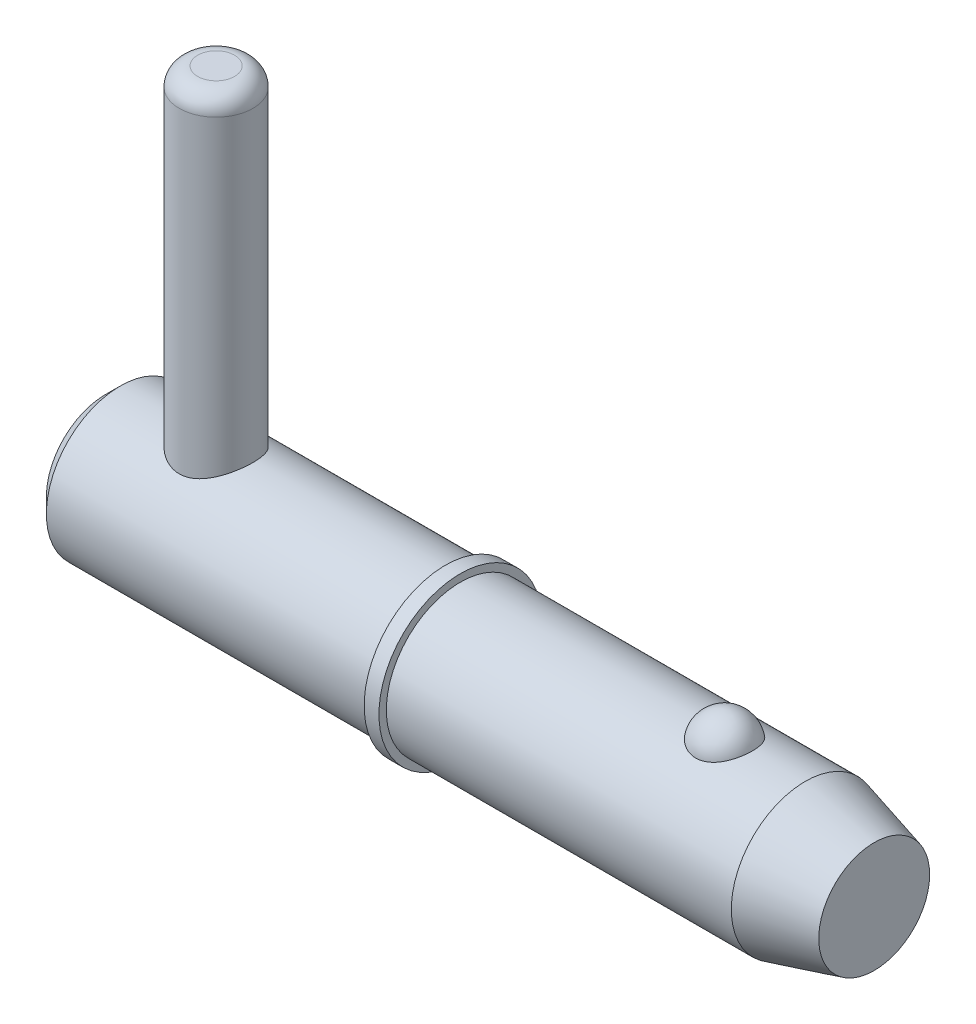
ISO-10303-21;
HEADER;
FILE_DESCRIPTION(('STEP AP214'),'2;1');
FILE_NAME('part.step','',(''),(''),'','','');
FILE_SCHEMA(('AUTOMOTIVE_DESIGN { 1 0 10303 214 1 1 1 1 }'));
ENDSEC;
DATA;
#1=APPLICATION_CONTEXT('core data for automotive mechanical design processes');
#2=APPLICATION_PROTOCOL_DEFINITION('international standard','automotive_design',2000,#1);
#3=PRODUCT_CONTEXT('',#1,'mechanical');
#4=PRODUCT('Part','Part','',(#3));
#5=PRODUCT_RELATED_PRODUCT_CATEGORY('part','',(#4));
#6=PRODUCT_DEFINITION_FORMATION('','',#4);
#7=PRODUCT_DEFINITION_CONTEXT('part definition',#1,'design');
#8=PRODUCT_DEFINITION('design','',#6,#7);
#9=PRODUCT_DEFINITION_SHAPE('','',#8);
#10=(LENGTH_UNIT() NAMED_UNIT(*) SI_UNIT(.MILLI.,.METRE.));
#11=(NAMED_UNIT(*) PLANE_ANGLE_UNIT() SI_UNIT($,.RADIAN.));
#12=(NAMED_UNIT(*) SI_UNIT($,.STERADIAN.) SOLID_ANGLE_UNIT());
#13=UNCERTAINTY_MEASURE_WITH_UNIT(LENGTH_MEASURE(1.E-05),#10,'distance_accuracy_value','');
#14=(GEOMETRIC_REPRESENTATION_CONTEXT(3) GLOBAL_UNCERTAINTY_ASSIGNED_CONTEXT((#13)) GLOBAL_UNIT_ASSIGNED_CONTEXT((#10,
#11,#12)) REPRESENTATION_CONTEXT('',''));
#15=CARTESIAN_POINT('',(0.,0.,0.));
#16=DIRECTION('',(0.,0.,1.));
#17=DIRECTION('',(1.,0.,0.));
#18=AXIS2_PLACEMENT_3D('',#15,#16,#17);
#19=CARTESIAN_POINT('',(5.94,21.43,0.));
#20=DIRECTION('',(0.,-1.,0.));
#21=DIRECTION('',(0.,0.,-1.));
#22=AXIS2_PLACEMENT_3D('',#19,#20,#21);
#23=CYLINDRICAL_SURFACE('',#22,1.98);
#24=CARTESIAN_POINT('',(5.94,-2.98,0.));
#25=DIRECTION('',(0.,1.,0.));
#26=DIRECTION('',(0.,0.,1.));
#27=AXIS2_PLACEMENT_3D('',#24,#25,#26);
#28=CIRCLE('',#27,1.98);
#29=CARTESIAN_POINT('',(5.94,-2.98,1.98));
#30=VERTEX_POINT('',#29);
#31=EDGE_CURVE('P0_E25',#30,#30,#28,.T.);
#32=ORIENTED_EDGE('',*,*,#31,.T.);
#33=EDGE_LOOP('',(#32));
#34=FACE_BOUND('',#33,.T.);
#35=CARTESIAN_POINT('',(5.94,20.44,0.));
#36=DIRECTION('',(0.,1.,0.));
#37=DIRECTION('',(0.,0.,1.));
#38=AXIS2_PLACEMENT_3D('',#35,#36,#37);
#39=CIRCLE('',#38,1.98);
#40=CARTESIAN_POINT('',(5.94,20.44,1.98));
#41=VERTEX_POINT('',#40);
#42=EDGE_CURVE('P0_E29',#41,#41,#39,.F.);
#43=ORIENTED_EDGE('',*,*,#42,.T.);
#44=EDGE_LOOP('',(#43));
#45=FACE_BOUND('',#44,.T.);
#46=ADVANCED_FACE('P0_F14',(#34,#45),#23,.T.);
#47=CARTESIAN_POINT('',(5.94,21.43,0.));
#48=DIRECTION('',(0.,1.,0.));
#49=DIRECTION('',(0.,0.,1.));
#50=AXIS2_PLACEMENT_3D('',#47,#48,#49);
#51=PLANE('',#50);
#52=CARTESIAN_POINT('',(5.94,21.43,0.));
#53=DIRECTION('',(0.,1.,0.));
#54=DIRECTION('',(0.,0.,1.));
#55=AXIS2_PLACEMENT_3D('',#52,#53,#54);
#56=CIRCLE('',#55,0.99);
#57=CARTESIAN_POINT('',(5.94,21.43,0.99));
#58=VERTEX_POINT('',#57);
#59=EDGE_CURVE('P0_E10',#58,#58,#56,.T.);
#60=ORIENTED_EDGE('',*,*,#59,.T.);
#61=EDGE_LOOP('',(#60));
#62=FACE_BOUND('',#61,.T.);
#63=ADVANCED_FACE('P0_F46',(#62),#51,.T.);
#64=CARTESIAN_POINT('',(5.94,-3.97,0.));
#65=DIRECTION('',(0.,1.,0.));
#66=DIRECTION('',(0.,0.,1.));
#67=AXIS2_PLACEMENT_3D('',#64,#65,#66);
#68=PLANE('',#67);
#69=CARTESIAN_POINT('',(5.94,-3.97,0.));
#70=DIRECTION('',(0.,1.,0.));
#71=DIRECTION('',(0.,0.,1.));
#72=AXIS2_PLACEMENT_3D('',#69,#70,#71);
#73=CIRCLE('',#72,0.99);
#74=CARTESIAN_POINT('',(5.94,-3.97,0.99));
#75=VERTEX_POINT('',#74);
#76=EDGE_CURVE('P0_E21',#75,#75,#73,.F.);
#77=ORIENTED_EDGE('',*,*,#76,.T.);
#78=EDGE_LOOP('',(#77));
#79=FACE_BOUND('',#78,.T.);
#80=ADVANCED_FACE('P0_F43',(#79),#68,.F.);
#81=CARTESIAN_POINT('',(5.94,-2.98,0.));
#82=DIRECTION('',(0.,1.,0.));
#83=DIRECTION('',(0.,0.,1.));
#84=AXIS2_PLACEMENT_3D('',#81,#82,#83);
#85=DEGENERATE_TOROIDAL_SURFACE('',#84,0.99,0.99,.T.);
#86=ORIENTED_EDGE('',*,*,#76,.F.);
#87=EDGE_LOOP('',(#86));
#88=FACE_BOUND('',#87,.T.);
#89=ORIENTED_EDGE('',*,*,#31,.F.);
#90=EDGE_LOOP('',(#89));
#91=FACE_BOUND('',#90,.T.);
#92=ADVANCED_FACE('P0_F38',(#88,#91),#85,.T.);
#93=CARTESIAN_POINT('',(5.94,20.44,0.));
#94=DIRECTION('',(0.,1.,0.));
#95=DIRECTION('',(0.,0.,1.));
#96=AXIS2_PLACEMENT_3D('',#93,#94,#95);
#97=DEGENERATE_TOROIDAL_SURFACE('',#96,0.99,0.99,.T.);
#98=ORIENTED_EDGE('',*,*,#42,.F.);
#99=EDGE_LOOP('',(#98));
#100=FACE_BOUND('',#99,.T.);
#101=ORIENTED_EDGE('',*,*,#59,.F.);
#102=EDGE_LOOP('',(#101));
#103=FACE_BOUND('',#102,.T.);
#104=ADVANCED_FACE('P0_F16',(#100,#103),#97,.T.);
#105=CLOSED_SHELL('',(#46,#63,#80,#92,#104));
#106=MANIFOLD_SOLID_BREP('P0_B1',#105);
#107=CARTESIAN_POINT('',(0.,0.,0.));
#108=DIRECTION('',(1.,0.,0.));
#109=DIRECTION('',(0.,0.,-1.));
#110=AXIS2_PLACEMENT_3D('',#107,#108,#109);
#111=CYLINDRICAL_SURFACE('',#110,3.97);
#112=CARTESIAN_POINT('',(37.5759395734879,0.,0.));
#113=DIRECTION('',(1.,0.,0.));
#114=DIRECTION('',(0.,0.,-1.));
#115=AXIS2_PLACEMENT_3D('',#112,#113,#114);
#116=CIRCLE('',#115,3.97);
#117=CARTESIAN_POINT('',(37.5759395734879,0.,-3.97));
#118=VERTEX_POINT('',#117);
#119=EDGE_CURVE('P1_E81',#118,#118,#116,.T.);
#120=ORIENTED_EDGE('',*,*,#119,.F.);
#121=EDGE_LOOP('',(#120));
#122=FACE_BOUND('',#121,.T.);
#123=CARTESIAN_POINT('',(19.05,0.,0.));
#124=DIRECTION('',(1.,0.,0.));
#125=DIRECTION('',(0.,0.,-1.));
#126=AXIS2_PLACEMENT_3D('',#123,#124,#125);
#127=CIRCLE('',#126,3.97);
#128=CARTESIAN_POINT('',(19.05,0.,-3.97));
#129=VERTEX_POINT('',#128);
#130=EDGE_CURVE('P1_E85',#129,#129,#127,.T.);
#131=ORIENTED_EDGE('',*,*,#130,.T.);
#132=EDGE_LOOP('',(#131));
#133=FACE_BOUND('',#132,.T.);
#134=CARTESIAN_POINT('',(33.2451922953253,3.65715365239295,1.54470941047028));
#135=CARTESIAN_POINT('',(33.1652448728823,3.65716001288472,1.54470290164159));
#136=CARTESIAN_POINT('',(33.0851650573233,3.65987074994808,1.53832549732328));
#137=CARTESIAN_POINT('',(32.9272374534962,3.6704221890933,1.51297018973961));
#138=CARTESIAN_POINT('',(32.8493961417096,3.67827646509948,1.49395894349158));
#139=CARTESIAN_POINT('',(32.6984614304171,3.69818848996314,1.44395950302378));
#140=CARTESIAN_POINT('',(32.6253560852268,3.71023513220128,1.41300293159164));
#141=CARTESIAN_POINT('',(32.4855630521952,3.7372183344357,1.34000212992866));
#142=CARTESIAN_POINT('',(32.4188725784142,3.75215363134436,1.29796274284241));
#143=CARTESIAN_POINT('',(32.2914886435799,3.78384968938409,1.20248834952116));
#144=CARTESIAN_POINT('',(32.2310299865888,3.80065129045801,1.14875388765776));
#145=CARTESIAN_POINT('',(32.1196942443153,3.83398532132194,1.03205417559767));
#146=CARTESIAN_POINT('',(32.0688200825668,3.85051766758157,0.969086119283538));
#147=CARTESIAN_POINT('',(31.9756321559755,3.88238608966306,0.832526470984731));
#148=CARTESIAN_POINT('',(31.9337961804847,3.89763698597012,0.75858832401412));
#149=CARTESIAN_POINT('',(31.8625108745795,3.92451063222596,0.604352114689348));
#150=CARTESIAN_POINT('',(31.8330623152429,3.93613315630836,0.524053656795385));
#151=CARTESIAN_POINT('',(31.7868927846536,3.95467606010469,0.358403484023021));
#152=CARTESIAN_POINT('',(31.7703127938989,3.96154426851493,0.273006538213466));
#153=CARTESIAN_POINT('',(31.750756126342,3.96967008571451,0.100408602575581));
#154=CARTESIAN_POINT('',(31.7477789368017,3.97092790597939,0.0132076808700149));
#155=CARTESIAN_POINT('',(31.7554587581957,3.96771794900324,-0.159844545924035));
#156=CARTESIAN_POINT('',(31.7660164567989,3.96329187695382,-0.245701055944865));
#157=CARTESIAN_POINT('',(31.8003800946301,3.94923163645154,-0.414277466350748));
#158=CARTESIAN_POINT('',(31.8241862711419,3.93959737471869,-0.496997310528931));
#159=CARTESIAN_POINT('',(31.8846114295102,3.91607752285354,-0.657113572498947));
#160=CARTESIAN_POINT('',(31.9212495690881,3.90218558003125,-0.734501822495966));
#161=CARTESIAN_POINT('',(32.0065935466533,3.87158287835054,-0.881704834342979));
#162=CARTESIAN_POINT('',(32.0553004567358,3.8548718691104,-0.951518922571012));
#163=CARTESIAN_POINT('',(32.1641161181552,3.82028735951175,-1.08208159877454));
#164=CARTESIAN_POINT('',(32.2242955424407,3.80240713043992,-1.14276958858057));
#165=CARTESIAN_POINT('',(32.354493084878,3.76758161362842,-1.2528243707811));
#166=CARTESIAN_POINT('',(32.4245105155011,3.75063626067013,-1.30219195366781));
#167=CARTESIAN_POINT('',(32.57118160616,3.71998948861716,-1.38729709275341));
#168=CARTESIAN_POINT('',(32.6476813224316,3.70623183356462,-1.42327904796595));
#169=CARTESIAN_POINT('',(32.8062981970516,3.68323188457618,-1.48178996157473));
#170=CARTESIAN_POINT('',(32.8884132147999,3.67398788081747,-1.5043240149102));
#171=CARTESIAN_POINT('',(33.0514810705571,3.6615216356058,-1.53440939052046));
#172=CARTESIAN_POINT('',(33.1322840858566,3.65801951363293,-1.54265826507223));
#173=CARTESIAN_POINT('',(33.2942085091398,3.65657341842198,-1.5460842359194));
#174=CARTESIAN_POINT('',(33.3753298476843,3.65862829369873,-1.54126404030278));
#175=CARTESIAN_POINT('',(33.5328122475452,3.66788969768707,-1.51908474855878));
#176=CARTESIAN_POINT('',(33.6092422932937,3.67492621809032,-1.50213925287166));
#177=CARTESIAN_POINT('',(33.7580412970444,3.69318404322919,-1.45666982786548));
#178=CARTESIAN_POINT('',(33.8304099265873,3.70440568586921,-1.42814496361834));
#179=CARTESIAN_POINT('',(33.9708029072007,3.73012749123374,-1.35956319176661));
#180=CARTESIAN_POINT('',(34.0387000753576,3.74469307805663,-1.31927107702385));
#181=CARTESIAN_POINT('',(34.1668649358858,3.77545272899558,-1.22847440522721));
#182=CARTESIAN_POINT('',(34.2271308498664,3.79164717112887,-1.17796747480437));
#183=CARTESIAN_POINT('',(34.3416346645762,3.82490325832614,-1.06519260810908));
#184=CARTESIAN_POINT('',(34.3954137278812,3.84196735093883,-1.00245914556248));
#185=CARTESIAN_POINT('',(34.4920988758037,3.87439863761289,-0.868715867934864));
#186=CARTESIAN_POINT('',(34.5350030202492,3.88976552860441,-0.797704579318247));
#187=CARTESIAN_POINT('',(34.610266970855,3.91771381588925,-0.646896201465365));
#188=CARTESIAN_POINT('',(34.6422532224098,3.93019255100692,-0.566893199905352));
#189=CARTESIAN_POINT('',(34.6931101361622,3.95043886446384,-0.40225513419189));
#190=CARTESIAN_POINT('',(34.7119807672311,3.95820643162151,-0.317620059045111));
#191=CARTESIAN_POINT('',(34.7362162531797,3.96823733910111,-0.14615699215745));
#192=CARTESIAN_POINT('',(34.7415874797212,3.970503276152,-0.0593300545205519));
#193=CARTESIAN_POINT('',(34.7387309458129,3.96930811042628,0.114057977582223));
#194=CARTESIAN_POINT('',(34.7305035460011,3.9658471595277,0.200619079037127));
#195=CARTESIAN_POINT('',(34.7007063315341,3.95358562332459,0.370506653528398));
#196=CARTESIAN_POINT('',(34.6792129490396,3.94481563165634,0.453848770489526));
#197=CARTESIAN_POINT('',(34.6233839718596,3.92284586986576,0.615497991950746));
#198=CARTESIAN_POINT('',(34.5890474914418,3.90964579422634,0.693804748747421));
#199=CARTESIAN_POINT('',(34.5079702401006,3.88006987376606,0.843703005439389));
#200=CARTESIAN_POINT('',(34.4611536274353,3.86367478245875,0.915249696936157));
#201=CARTESIAN_POINT('',(34.3561897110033,3.82949741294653,1.04910810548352));
#202=CARTESIAN_POINT('',(34.2980428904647,3.81171519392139,1.11142021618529));
#203=CARTESIAN_POINT('',(34.1717433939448,3.77673366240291,1.22503948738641));
#204=CARTESIAN_POINT('',(34.1035970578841,3.75953398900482,1.27635357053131));
#205=CARTESIAN_POINT('',(33.9589009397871,3.72770506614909,1.36653336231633));
#206=CARTESIAN_POINT('',(33.882348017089,3.71307678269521,1.40539439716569));
#207=CARTESIAN_POINT('',(33.7257594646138,3.68864287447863,1.46830480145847));
#208=CARTESIAN_POINT('',(33.6459307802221,3.67869017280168,1.49281289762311));
#209=CARTESIAN_POINT('',(33.4829877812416,3.66414535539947,1.52817474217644));
#210=CARTESIAN_POINT('',(33.3998840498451,3.65953723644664,1.53906926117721));
#211=CARTESIAN_POINT('',(33.2927760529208,3.6573894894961,1.54414878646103));
#212=CARTESIAN_POINT('',(33.2689900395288,3.65715175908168,1.54471134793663));
#213=CARTESIAN_POINT('',(33.2451922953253,3.65715365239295,1.54470941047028));
#214=B_SPLINE_CURVE_WITH_KNOTS('',3,(#134,#135,#136,#137,#138,#139,#140,#141,#142,#143,#144,
#145,#146,#147,#148,#149,#150,#151,#152,#153,#154,#155,#156,#157,#158,#159,#160,#161,#162,#163,
#164,#165,#166,#167,#168,#169,#170,#171,#172,#173,#174,#175,#176,#177,#178,#179,#180,#181,#182,
#183,#184,#185,#186,#187,#188,#189,#190,#191,#192,#193,#194,#195,#196,#197,#198,#199,#200,#201,
#202,#203,#204,#205,#206,#207,#208,#209,#210,#211,#212,#213),.UNSPECIFIED.,.T.,.F.,(4,2,2,2,2,2,
2,2,2,2,2,2,2,2,2,2,2,2,2,2,2,2,2,2,2,2,2,2,2,2,2,2,2,2,2,2,2,2,2,4),(0.,0.239777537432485,
0.480190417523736,0.719971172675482,0.959647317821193,1.20639040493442,1.45320863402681,
1.7109367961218,1.96868099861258,2.22921052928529,2.48973023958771,2.74834928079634,
3.00697295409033,3.26598440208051,3.52501886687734,3.78570385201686,4.04637062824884,
4.30201257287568,4.55755760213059,4.80022994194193,5.04285200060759,5.27757006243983,
5.51230707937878,5.75210128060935,5.99195126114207,6.24392810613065,6.49594987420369,
6.75588818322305,7.01582710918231,7.27564332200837,7.53545264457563,7.79377886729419,
8.0521229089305,8.31207418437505,8.57201437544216,8.83179046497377,9.09166393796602,
9.34270057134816,9.59298357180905,9.66435753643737),.UNSPECIFIED.);
#215=CARTESIAN_POINT('',(33.2451922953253,3.65715365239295,1.54470941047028));
#216=VERTEX_POINT('',#215);
#217=EDGE_CURVE('P1_E35',#216,#216,#214,.T.);
#218=ORIENTED_EDGE('',*,*,#217,.T.);
#219=EDGE_LOOP('',(#218));
#220=FACE_BOUND('',#219,.T.);
#221=ADVANCED_FACE('P1_F13',(#122,#133,#220),#111,.T.);
#222=CARTESIAN_POINT('',(0.,0.,0.));
#223=DIRECTION('',(-1.,0.,0.));
#224=DIRECTION('',(0.,0.,1.));
#225=AXIS2_PLACEMENT_3D('',#222,#223,#224);
#226=PLANE('',#225);
#227=CARTESIAN_POINT('',(0.,0.,0.));
#228=DIRECTION('',(1.,0.,0.));
#229=DIRECTION('',(0.,0.,-1.));
#230=AXIS2_PLACEMENT_3D('',#227,#228,#229);
#231=CIRCLE('',#230,3.176);
#232=CARTESIAN_POINT('',(0.,0.,-3.176));
#233=VERTEX_POINT('',#232);
#234=EDGE_CURVE('P1_E9',#233,#233,#231,.T.);
#235=ORIENTED_EDGE('',*,*,#234,.F.);
#236=EDGE_LOOP('',(#235));
#237=FACE_BOUND('',#236,.T.);
#238=ADVANCED_FACE('P1_F15',(#237),#226,.T.);
#239=CARTESIAN_POINT('',(0.793999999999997,0.,0.));
#240=DIRECTION('',(1.,0.,0.));
#241=DIRECTION('',(0.,0.,-1.));
#242=AXIS2_PLACEMENT_3D('',#239,#240,#241);
#243=CONICAL_SURFACE('',#242,3.97,0.78539816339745);
#244=ORIENTED_EDGE('',*,*,#234,.T.);
#245=EDGE_LOOP('',(#244));
#246=FACE_BOUND('',#245,.T.);
#247=CARTESIAN_POINT('',(0.793999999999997,0.,0.));
#248=DIRECTION('',(1.,0.,0.));
#249=DIRECTION('',(0.,0.,-1.));
#250=AXIS2_PLACEMENT_3D('',#247,#248,#249);
#251=CIRCLE('',#250,3.97);
#252=CARTESIAN_POINT('',(0.793999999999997,0.,-3.97));
#253=VERTEX_POINT('',#252);
#254=EDGE_CURVE('P1_E26',#253,#253,#251,.T.);
#255=ORIENTED_EDGE('',*,*,#254,.F.);
#256=EDGE_LOOP('',(#255));
#257=FACE_BOUND('',#256,.T.);
#258=ADVANCED_FACE('P1_F77',(#246,#257),#243,.T.);
#259=CARTESIAN_POINT('',(0.,0.,0.));
#260=DIRECTION('',(1.,0.,0.));
#261=DIRECTION('',(0.,0.,-1.));
#262=AXIS2_PLACEMENT_3D('',#259,#260,#261);
#263=CYLINDRICAL_SURFACE('',#262,3.97);
#264=CARTESIAN_POINT('',(5.94,-3.44100276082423,1.98));
#265=CARTESIAN_POINT('',(5.8367885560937,-3.44101282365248,1.97999171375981));
#266=CARTESIAN_POINT('',(5.73344176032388,-3.44571749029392,1.97187534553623));
#267=CARTESIAN_POINT('',(5.52991905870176,-3.46385873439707,1.93981946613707));
#268=CARTESIAN_POINT('',(5.42975031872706,-3.47731375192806,1.91584653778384));
#269=CARTESIAN_POINT('',(5.23590869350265,-3.51100678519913,1.85336773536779));
#270=CARTESIAN_POINT('',(5.14220446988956,-3.53120882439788,1.81493880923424));
#271=CARTESIAN_POINT('',(4.9625969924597,-3.57606420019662,1.72487335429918));
#272=CARTESIAN_POINT('',(4.87669412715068,-3.6007177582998,1.67323616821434));
#273=CARTESIAN_POINT('',(4.70734412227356,-3.65417020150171,1.55325205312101));
#274=CARTESIAN_POINT('',(4.62467662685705,-3.68314323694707,1.4838818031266));
#275=CARTESIAN_POINT('',(4.47154355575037,-3.74056406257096,1.33252902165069));
#276=CARTESIAN_POINT('',(4.40108404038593,-3.76901158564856,1.25054026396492));
#277=CARTESIAN_POINT('',(4.26974803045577,-3.82445556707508,1.06956584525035));
#278=CARTESIAN_POINT('',(4.20982960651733,-3.8512271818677,0.969809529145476));
#279=CARTESIAN_POINT('',(4.10798077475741,-3.89804342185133,0.760047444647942));
#280=CARTESIAN_POINT('',(4.06603907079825,-3.91809226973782,0.650048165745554));
#281=CARTESIAN_POINT('',(4.00441878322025,-3.94794912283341,0.431181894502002));
#282=CARTESIAN_POINT('',(3.98337329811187,-3.95838209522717,0.322786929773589));
#283=CARTESIAN_POINT('',(3.9596425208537,-3.97016407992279,0.103541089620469));
#284=CARTESIAN_POINT('',(3.95694618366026,-3.97151855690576,-0.00730826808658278));
#285=CARTESIAN_POINT('',(3.9694599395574,-3.96528826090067,-0.218044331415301));
#286=CARTESIAN_POINT('',(3.98314071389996,-3.95846689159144,-0.318049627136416));
#287=CARTESIAN_POINT('',(4.02528522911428,-3.93780347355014,-0.514124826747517));
#288=CARTESIAN_POINT('',(4.05375007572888,-3.92396089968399,-0.61019443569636));
#289=CARTESIAN_POINT('',(4.12484256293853,-3.89028355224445,-0.797351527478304));
#290=CARTESIAN_POINT('',(4.16766142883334,-3.87036821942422,-0.888351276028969));
#291=CARTESIAN_POINT('',(4.26598377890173,-3.82634285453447,-1.06209448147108));
#292=CARTESIAN_POINT('',(4.32149181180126,-3.8022313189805,-1.14483496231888));
#293=CARTESIAN_POINT('',(4.44962332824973,-3.74940011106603,-1.30802500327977));
#294=CARTESIAN_POINT('',(4.52336636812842,-3.72046031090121,-1.38752498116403));
#295=CARTESIAN_POINT('',(4.68287656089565,-3.66269463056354,-1.53354043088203));
#296=CARTESIAN_POINT('',(4.7686527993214,-3.63386885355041,-1.60004599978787));
#297=CARTESIAN_POINT('',(4.9564069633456,-3.57763161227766,-1.72228426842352));
#298=CARTESIAN_POINT('',(5.05906485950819,-3.5504233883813,-1.77707534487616));
#299=CARTESIAN_POINT('',(5.27381412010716,-3.50334038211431,-1.86819784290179));
#300=CARTESIAN_POINT('',(5.38589553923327,-3.48345798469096,-1.90454844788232));
#301=CARTESIAN_POINT('',(5.6069795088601,-3.45548331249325,-1.95481643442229));
#302=CARTESIAN_POINT('',(5.71552407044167,-3.44658268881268,-1.97028113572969));
#303=CARTESIAN_POINT('',(5.93399639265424,-3.43928114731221,-1.98300600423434));
#304=CARTESIAN_POINT('',(6.04392313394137,-3.44087289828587,-1.98027888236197));
#305=CARTESIAN_POINT('',(6.24931618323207,-3.45351901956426,-1.95811780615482));
#306=CARTESIAN_POINT('',(6.34505668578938,-3.46352725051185,-1.94052989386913));
#307=CARTESIAN_POINT('',(6.53204702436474,-3.49033612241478,-1.89188242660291));
#308=CARTESIAN_POINT('',(6.62329540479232,-3.50713894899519,-1.86081853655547));
#309=CARTESIAN_POINT('',(6.80352105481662,-3.54655680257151,-1.78458666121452));
#310=CARTESIAN_POINT('',(6.89219712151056,-3.56940508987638,-1.73883178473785));
#311=CARTESIAN_POINT('',(7.06112449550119,-3.61813012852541,-1.63502913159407));
#312=CARTESIAN_POINT('',(7.14137144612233,-3.6440084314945,-1.57697504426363));
#313=CARTESIAN_POINT('',(7.30168083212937,-3.69977514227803,-1.44171920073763));
#314=CARTESIAN_POINT('',(7.38046039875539,-3.7297597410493,-1.36302972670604));
#315=CARTESIAN_POINT('',(7.52409649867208,-3.78754991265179,-1.19307190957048));
#316=CARTESIAN_POINT('',(7.58894840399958,-3.81535475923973,-1.10179940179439));
#317=CARTESIAN_POINT('',(7.70430122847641,-3.86658972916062,-0.906019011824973));
#318=CARTESIAN_POINT('',(7.75438714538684,-3.88988795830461,-0.801229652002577));
#319=CARTESIAN_POINT('',(7.83572184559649,-3.92848199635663,-0.583216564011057));
#320=CARTESIAN_POINT('',(7.86698708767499,-3.94378479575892,-0.470000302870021));
#321=CARTESIAN_POINT('',(7.90711051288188,-3.96355307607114,-0.249525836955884));
#322=CARTESIAN_POINT('',(7.91775648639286,-3.96888171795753,-0.142669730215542));
#323=CARTESIAN_POINT('',(7.92160247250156,-3.97079858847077,0.0714191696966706));
#324=CARTESIAN_POINT('',(7.91480852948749,-3.96738984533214,0.178651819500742));
#325=CARTESIAN_POINT('',(7.88515479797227,-3.9527181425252,0.383072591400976));
#326=CARTESIAN_POINT('',(7.8633739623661,-3.94198303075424,0.480459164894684));
#327=CARTESIAN_POINT('',(7.80581513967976,-3.91422178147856,0.670038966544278));
#328=CARTESIAN_POINT('',(7.77003513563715,-3.89719473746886,0.762231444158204));
#329=CARTESIAN_POINT('',(7.68389191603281,-3.85747818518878,0.943248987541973));
#330=CARTESIAN_POINT('',(7.63296879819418,-3.83457704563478,1.03175978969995));
#331=CARTESIAN_POINT('',(7.51869140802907,-3.7855122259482,1.19934744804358));
#332=CARTESIAN_POINT('',(7.45533142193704,-3.75934704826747,1.2784199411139));
#333=CARTESIAN_POINT('',(7.31068939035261,-3.70329841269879,1.433144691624));
#334=CARTESIAN_POINT('',(7.22825362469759,-3.67330340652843,1.50768183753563));
#335=CARTESIAN_POINT('',(7.05162367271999,-3.61514025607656,1.64226879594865));
#336=CARTESIAN_POINT('',(6.95741928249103,-3.58697372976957,1.70230590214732));
#337=CARTESIAN_POINT('',(6.75590859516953,-3.53504049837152,1.80775364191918));
#338=CARTESIAN_POINT('',(6.64828786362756,-3.51143624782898,1.85265616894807));
#339=CARTESIAN_POINT('',(6.48137774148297,-3.48289659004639,1.90544537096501));
#340=CARTESIAN_POINT('',(6.42488151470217,-3.4745323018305,1.9206071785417));
#341=CARTESIAN_POINT('',(6.31046920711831,-3.4604244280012,1.94591259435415));
#342=CARTESIAN_POINT('',(6.25255415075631,-3.45467900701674,1.95605971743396));
#343=CARTESIAN_POINT('',(6.1521444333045,-3.44728060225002,1.96905939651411));
#344=CARTESIAN_POINT('',(6.10985721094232,-3.44493297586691,1.97315742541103));
#345=CARTESIAN_POINT('',(6.02505433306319,-3.44179192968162,1.97862952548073));
#346=CARTESIAN_POINT('',(5.98253866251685,-3.44099861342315,1.98000341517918));
#347=CARTESIAN_POINT('',(5.94,-3.44100276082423,1.98));
#348=B_SPLINE_CURVE_WITH_KNOTS('',3,(#264,#265,#266,#267,#268,#269,#270,#271,#272,#273,#274,
#275,#276,#277,#278,#279,#280,#281,#282,#283,#284,#285,#286,#287,#288,#289,#290,#291,#292,#293,
#294,#295,#296,#297,#298,#299,#300,#301,#302,#303,#304,#305,#306,#307,#308,#309,#310,#311,#312,
#313,#314,#315,#316,#317,#318,#319,#320,#321,#322,#323,#324,#325,#326,#327,#328,#329,#330,#331,
#332,#333,#334,#335,#336,#337,#338,#339,#340,#341,#342,#343,#344,#345,#346,#347),.UNSPECIFIED.,
.T.,.F.,(4,2,2,2,2,2,2,2,2,2,2,2,2,2,2,2,2,2,2,2,2,2,2,2,2,2,2,2,2,2,2,2,2,2,2,2,2,2,2,2,2,4),
(0.,0.309462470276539,0.619579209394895,0.928068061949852,1.23657226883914,1.57038619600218,
1.90436536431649,2.26071614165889,2.61684266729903,2.94773555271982,3.27842924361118,
3.58050679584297,3.88260694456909,4.18890317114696,4.49530936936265,4.83057163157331,
5.1660884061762,5.52272472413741,5.87898927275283,6.20706708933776,6.53491569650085,
6.82716910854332,7.11951660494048,7.42541184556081,7.73146442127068,8.07586334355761,
8.42037652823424,8.77380887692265,9.12693169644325,9.44775848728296,9.76847409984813,
10.0682302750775,10.3680296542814,10.6806938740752,10.9935020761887,11.3373031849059,
11.6814044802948,12.0361164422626,12.2131519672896,12.3900632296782,12.5175998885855,
12.6451450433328),.UNSPECIFIED.);
#349=CARTESIAN_POINT('',(5.94,-3.44100276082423,1.98));
#350=VERTEX_POINT('',#349);
#351=EDGE_CURVE('P1_E17',#350,#350,#348,.T.);
#352=ORIENTED_EDGE('',*,*,#351,.F.);
#353=EDGE_LOOP('',(#352));
#354=FACE_BOUND('',#353,.T.);
#355=CARTESIAN_POINT('',(5.94,3.44100276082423,1.98));
#356=CARTESIAN_POINT('',(6.0432114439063,3.44101282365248,1.97999171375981));
#357=CARTESIAN_POINT('',(6.14655823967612,3.44571749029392,1.97187534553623));
#358=CARTESIAN_POINT('',(6.35008094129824,3.46385873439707,1.93981946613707));
#359=CARTESIAN_POINT('',(6.45024968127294,3.47731375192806,1.91584653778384));
#360=CARTESIAN_POINT('',(6.64409130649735,3.51100678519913,1.85336773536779));
#361=CARTESIAN_POINT('',(6.73779553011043,3.53120882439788,1.81493880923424));
#362=CARTESIAN_POINT('',(6.91740300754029,3.57606420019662,1.72487335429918));
#363=CARTESIAN_POINT('',(7.00330587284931,3.6007177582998,1.67323616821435));
#364=CARTESIAN_POINT('',(7.17265587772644,3.65417020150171,1.55325205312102));
#365=CARTESIAN_POINT('',(7.25532337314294,3.68314323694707,1.4838818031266));
#366=CARTESIAN_POINT('',(7.40845644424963,3.74056406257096,1.3325290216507));
#367=CARTESIAN_POINT('',(7.47891595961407,3.76901158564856,1.25054026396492));
#368=CARTESIAN_POINT('',(7.61025196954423,3.82445556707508,1.06956584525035));
#369=CARTESIAN_POINT('',(7.67017039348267,3.8512271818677,0.969809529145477));
#370=CARTESIAN_POINT('',(7.77201922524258,3.89804342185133,0.760047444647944));
#371=CARTESIAN_POINT('',(7.81396092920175,3.91809226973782,0.650048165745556));
#372=CARTESIAN_POINT('',(7.87558121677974,3.94794912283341,0.431181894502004));
#373=CARTESIAN_POINT('',(7.89662670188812,3.95838209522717,0.322786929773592));
#374=CARTESIAN_POINT('',(7.9203574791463,3.97016407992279,0.103541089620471));
#375=CARTESIAN_POINT('',(7.92305381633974,3.97151855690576,-0.00730826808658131));
#376=CARTESIAN_POINT('',(7.9105400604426,3.96528826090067,-0.2180443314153));
#377=CARTESIAN_POINT('',(7.89685928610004,3.95846689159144,-0.318049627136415));
#378=CARTESIAN_POINT('',(7.85471477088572,3.93780347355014,-0.514124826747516));
#379=CARTESIAN_POINT('',(7.82624992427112,3.92396089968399,-0.61019443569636));
#380=CARTESIAN_POINT('',(7.75515743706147,3.89028355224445,-0.797351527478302));
#381=CARTESIAN_POINT('',(7.71233857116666,3.87036821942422,-0.888351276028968));
#382=CARTESIAN_POINT('',(7.61401622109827,3.82634285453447,-1.06209448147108));
#383=CARTESIAN_POINT('',(7.55850818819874,3.8022313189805,-1.14483496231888));
#384=CARTESIAN_POINT('',(7.43037667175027,3.74940011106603,-1.30802500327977));
#385=CARTESIAN_POINT('',(7.35663363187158,3.72046031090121,-1.38752498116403));
#386=CARTESIAN_POINT('',(7.19712343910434,3.66269463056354,-1.53354043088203));
#387=CARTESIAN_POINT('',(7.1113472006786,3.63386885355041,-1.60004599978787));
#388=CARTESIAN_POINT('',(6.9235930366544,3.57763161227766,-1.72228426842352));
#389=CARTESIAN_POINT('',(6.82093514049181,3.5504233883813,-1.77707534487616));
#390=CARTESIAN_POINT('',(6.60618587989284,3.50334038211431,-1.86819784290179));
#391=CARTESIAN_POINT('',(6.49410446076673,3.48345798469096,-1.90454844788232));
#392=CARTESIAN_POINT('',(6.2730204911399,3.45548331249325,-1.95481643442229));
#393=CARTESIAN_POINT('',(6.16447592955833,3.44658268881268,-1.97028113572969));
#394=CARTESIAN_POINT('',(5.94600360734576,3.43928114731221,-1.98300600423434));
#395=CARTESIAN_POINT('',(5.83607686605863,3.44087289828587,-1.98027888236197));
#396=CARTESIAN_POINT('',(5.63068381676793,3.45351901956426,-1.95811780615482));
#397=CARTESIAN_POINT('',(5.53494331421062,3.46352725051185,-1.94052989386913));
#398=CARTESIAN_POINT('',(5.34795297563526,3.49033612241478,-1.89188242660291));
#399=CARTESIAN_POINT('',(5.25670459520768,3.50713894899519,-1.86081853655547));
#400=CARTESIAN_POINT('',(5.07647894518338,3.54655680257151,-1.78458666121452));
#401=CARTESIAN_POINT('',(4.98780287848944,3.56940508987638,-1.73883178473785));
#402=CARTESIAN_POINT('',(4.81887550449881,3.61813012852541,-1.63502913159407));
#403=CARTESIAN_POINT('',(4.73862855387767,3.6440084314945,-1.57697504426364));
#404=CARTESIAN_POINT('',(4.57831916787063,3.69977514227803,-1.44171920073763));
#405=CARTESIAN_POINT('',(4.49953960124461,3.7297597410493,-1.36302972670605));
#406=CARTESIAN_POINT('',(4.35590350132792,3.78754991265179,-1.19307190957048));
#407=CARTESIAN_POINT('',(4.29105159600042,3.81535475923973,-1.10179940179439));
#408=CARTESIAN_POINT('',(4.17569877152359,3.86658972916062,-0.906019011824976));
#409=CARTESIAN_POINT('',(4.12561285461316,3.88988795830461,-0.80122965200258));
#410=CARTESIAN_POINT('',(4.04427815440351,3.92848199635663,-0.58321656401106));
#411=CARTESIAN_POINT('',(4.01301291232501,3.94378479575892,-0.470000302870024));
#412=CARTESIAN_POINT('',(3.97288948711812,3.96355307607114,-0.249525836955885));
#413=CARTESIAN_POINT('',(3.96224351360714,3.96888171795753,-0.142669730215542));
#414=CARTESIAN_POINT('',(3.95839752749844,3.97079858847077,0.0714191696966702));
#415=CARTESIAN_POINT('',(3.96519147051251,3.96738984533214,0.178651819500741));
#416=CARTESIAN_POINT('',(3.99484520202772,3.9527181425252,0.383072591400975));
#417=CARTESIAN_POINT('',(4.01662603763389,3.94198303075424,0.480459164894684));
#418=CARTESIAN_POINT('',(4.07418486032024,3.91422178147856,0.670038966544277));
#419=CARTESIAN_POINT('',(4.10996486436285,3.89719473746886,0.762231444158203));
#420=CARTESIAN_POINT('',(4.19610808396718,3.85747818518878,0.943248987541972));
#421=CARTESIAN_POINT('',(4.24703120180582,3.83457704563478,1.03175978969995));
#422=CARTESIAN_POINT('',(4.36130859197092,3.7855122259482,1.19934744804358));
#423=CARTESIAN_POINT('',(4.42466857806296,3.75934704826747,1.2784199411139));
#424=CARTESIAN_POINT('',(4.56931060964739,3.70329841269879,1.433144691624));
#425=CARTESIAN_POINT('',(4.65174637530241,3.67330340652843,1.50768183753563));
#426=CARTESIAN_POINT('',(4.82837632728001,3.61514025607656,1.64226879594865));
#427=CARTESIAN_POINT('',(4.92258071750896,3.58697372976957,1.70230590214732));
#428=CARTESIAN_POINT('',(5.12409140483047,3.53504049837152,1.80775364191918));
#429=CARTESIAN_POINT('',(5.23171213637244,3.51143624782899,1.85265616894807));
#430=CARTESIAN_POINT('',(5.39862225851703,3.48289659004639,1.90544537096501));
#431=CARTESIAN_POINT('',(5.45511848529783,3.4745323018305,1.9206071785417));
#432=CARTESIAN_POINT('',(5.56953079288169,3.4604244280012,1.94591259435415));
#433=CARTESIAN_POINT('',(5.62744584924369,3.45467900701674,1.95605971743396));
#434=CARTESIAN_POINT('',(5.7278555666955,3.44728060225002,1.9690593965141));
#435=CARTESIAN_POINT('',(5.77014278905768,3.44493297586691,1.97315742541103));
#436=CARTESIAN_POINT('',(5.85494566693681,3.44179192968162,1.97862952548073));
#437=CARTESIAN_POINT('',(5.89746133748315,3.44099861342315,1.98000341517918));
#438=CARTESIAN_POINT('',(5.94,3.44100276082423,1.98));
#439=B_SPLINE_CURVE_WITH_KNOTS('',3,(#355,#356,#357,#358,#359,#360,#361,#362,#363,#364,#365,
#366,#367,#368,#369,#370,#371,#372,#373,#374,#375,#376,#377,#378,#379,#380,#381,#382,#383,#384,
#385,#386,#387,#388,#389,#390,#391,#392,#393,#394,#395,#396,#397,#398,#399,#400,#401,#402,#403,
#404,#405,#406,#407,#408,#409,#410,#411,#412,#413,#414,#415,#416,#417,#418,#419,#420,#421,#422,
#423,#424,#425,#426,#427,#428,#429,#430,#431,#432,#433,#434,#435,#436,#437,#438),.UNSPECIFIED.,
.T.,.F.,(4,2,2,2,2,2,2,2,2,2,2,2,2,2,2,2,2,2,2,2,2,2,2,2,2,2,2,2,2,2,2,2,2,2,2,2,2,2,2,2,2,4),
(0.,0.309462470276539,0.619579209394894,0.928068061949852,1.23657226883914,1.57038619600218,
1.90436536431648,2.26071614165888,2.61684266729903,2.94773555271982,3.27842924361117,
3.58050679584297,3.88260694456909,4.18890317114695,4.49530936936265,4.83057163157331,
5.1660884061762,5.5227247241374,5.87898927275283,6.20706708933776,6.53491569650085,
6.82716910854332,7.11951660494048,7.42541184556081,7.73146442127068,8.07586334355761,
8.42037652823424,8.77380887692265,9.12693169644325,9.44775848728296,9.76847409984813,
10.0682302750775,10.3680296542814,10.6806938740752,10.9935020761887,11.3373031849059,
11.6814044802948,12.0361164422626,12.2131519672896,12.3900632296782,12.5175998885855,
12.6451450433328),.UNSPECIFIED.);
#440=CARTESIAN_POINT('',(5.94,3.44100276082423,1.98));
#441=VERTEX_POINT('',#440);
#442=EDGE_CURVE('P1_E43',#441,#441,#439,.T.);
#443=ORIENTED_EDGE('',*,*,#442,.F.);
#444=EDGE_LOOP('',(#443));
#445=FACE_BOUND('',#444,.T.);
#446=ORIENTED_EDGE('',*,*,#254,.T.);
#447=EDGE_LOOP('',(#446));
#448=FACE_BOUND('',#447,.T.);
#449=CARTESIAN_POINT('',(18.256,0.,0.));
#450=DIRECTION('',(1.,0.,0.));
#451=DIRECTION('',(0.,0.,-1.));
#452=AXIS2_PLACEMENT_3D('',#449,#450,#451);
#453=CIRCLE('',#452,3.97);
#454=CARTESIAN_POINT('',(18.256,0.,-3.97));
#455=VERTEX_POINT('',#454);
#456=EDGE_CURVE('P1_E31',#455,#455,#453,.T.);
#457=ORIENTED_EDGE('',*,*,#456,.F.);
#458=EDGE_LOOP('',(#457));
#459=FACE_BOUND('',#458,.T.);
#460=ADVANCED_FACE('P1_F103',(#354,#445,#448,#459),#263,.T.);
#461=CARTESIAN_POINT('',(18.256,3.97,0.));
#462=DIRECTION('',(-1.,0.,0.));
#463=DIRECTION('',(0.,0.,1.));
#464=AXIS2_PLACEMENT_3D('',#461,#462,#463);
#465=PLANE('',#464);
#466=ORIENTED_EDGE('',*,*,#456,.T.);
#467=EDGE_LOOP('',(#466));
#468=FACE_BOUND('',#467,.T.);
#469=CARTESIAN_POINT('',(18.256,0.,0.));
#470=DIRECTION('',(1.,0.,0.));
#471=DIRECTION('',(0.,0.,-1.));
#472=AXIS2_PLACEMENT_3D('',#469,#470,#471);
#473=CIRCLE('',#472,4.367);
#474=CARTESIAN_POINT('',(18.256,0.,-4.367));
#475=VERTEX_POINT('',#474);
#476=EDGE_CURVE('P1_E91',#475,#475,#473,.T.);
#477=ORIENTED_EDGE('',*,*,#476,.F.);
#478=EDGE_LOOP('',(#477));
#479=FACE_BOUND('',#478,.T.);
#480=ADVANCED_FACE('P1_F100',(#468,#479),#465,.T.);
#481=CARTESIAN_POINT('',(0.,0.,0.));
#482=DIRECTION('',(1.,0.,0.));
#483=DIRECTION('',(0.,0.,-1.));
#484=AXIS2_PLACEMENT_3D('',#481,#482,#483);
#485=CYLINDRICAL_SURFACE('',#484,4.367);
#486=ORIENTED_EDGE('',*,*,#476,.T.);
#487=EDGE_LOOP('',(#486));
#488=FACE_BOUND('',#487,.T.);
#489=CARTESIAN_POINT('',(19.05,0.,0.));
#490=DIRECTION('',(1.,0.,0.));
#491=DIRECTION('',(0.,0.,-1.));
#492=AXIS2_PLACEMENT_3D('',#489,#490,#491);
#493=CIRCLE('',#492,4.367);
#494=CARTESIAN_POINT('',(19.05,0.,-4.367));
#495=VERTEX_POINT('',#494);
#496=EDGE_CURVE('P1_E88',#495,#495,#493,.T.);
#497=ORIENTED_EDGE('',*,*,#496,.F.);
#498=EDGE_LOOP('',(#497));
#499=FACE_BOUND('',#498,.T.);
#500=ADVANCED_FACE('P1_F68',(#488,#499),#485,.T.);
#501=CARTESIAN_POINT('',(19.05,4.367,0.));
#502=DIRECTION('',(1.,0.,0.));
#503=DIRECTION('',(0.,0.,-1.));
#504=AXIS2_PLACEMENT_3D('',#501,#502,#503);
#505=PLANE('',#504);
#506=ORIENTED_EDGE('',*,*,#496,.T.);
#507=EDGE_LOOP('',(#506));
#508=FACE_BOUND('',#507,.T.);
#509=ORIENTED_EDGE('',*,*,#130,.F.);
#510=EDGE_LOOP('',(#509));
#511=FACE_BOUND('',#510,.T.);
#512=ADVANCED_FACE('P1_F62',(#508,#511),#505,.T.);
#513=CARTESIAN_POINT('',(41.28,0.,0.));
#514=DIRECTION('',(-1.,0.,0.));
#515=DIRECTION('',(0.,0.,1.));
#516=AXIS2_PLACEMENT_3D('',#513,#514,#515);
#517=CONICAL_SURFACE('',#516,2.97750000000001,0.26179938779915);
#518=ORIENTED_EDGE('',*,*,#119,.T.);
#519=EDGE_LOOP('',(#518));
#520=FACE_BOUND('',#519,.T.);
#521=CARTESIAN_POINT('',(41.28,0.,0.));
#522=DIRECTION('',(1.,0.,0.));
#523=DIRECTION('',(0.,0.,-1.));
#524=AXIS2_PLACEMENT_3D('',#521,#522,#523);
#525=CIRCLE('',#524,2.97750000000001);
#526=CARTESIAN_POINT('',(41.28,0.,-2.97750000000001));
#527=VERTEX_POINT('',#526);
#528=EDGE_CURVE('P1_E42',#527,#527,#525,.T.);
#529=ORIENTED_EDGE('',*,*,#528,.F.);
#530=EDGE_LOOP('',(#529));
#531=FACE_BOUND('',#530,.T.);
#532=ADVANCED_FACE('P1_F59',(#520,#531),#517,.T.);
#533=CARTESIAN_POINT('',(41.28,2.97750000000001,0.));
#534=DIRECTION('',(1.,0.,0.));
#535=DIRECTION('',(0.,0.,-1.));
#536=AXIS2_PLACEMENT_3D('',#533,#534,#535);
#537=PLANE('',#536);
#538=ORIENTED_EDGE('',*,*,#528,.T.);
#539=EDGE_LOOP('',(#538));
#540=FACE_BOUND('',#539,.T.);
#541=ADVANCED_FACE('P1_F55',(#540),#537,.T.);
#542=CARTESIAN_POINT('',(33.2451922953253,3.573,0.));
#543=DIRECTION('',(-1.,0.,0.));
#544=DIRECTION('',(0.,1.,0.));
#545=AXIS2_PLACEMENT_3D('',#542,#543,#544);
#546=SPHERICAL_SURFACE('',#545,1.54699999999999);
#547=ORIENTED_EDGE('',*,*,#217,.F.);
#548=EDGE_LOOP('',(#547));
#549=FACE_BOUND('',#548,.T.);
#550=ADVANCED_FACE('P1_F50',(#549),#546,.T.);
#551=CARTESIAN_POINT('',(5.94,-4.367,0.));
#552=DIRECTION('',(0.,1.,0.));
#553=DIRECTION('',(0.,0.,1.));
#554=AXIS2_PLACEMENT_3D('',#551,#552,#553);
#555=CYLINDRICAL_SURFACE('',#554,1.98);
#556=ORIENTED_EDGE('',*,*,#351,.T.);
#557=EDGE_LOOP('',(#556));
#558=FACE_BOUND('',#557,.T.);
#559=ORIENTED_EDGE('',*,*,#442,.T.);
#560=EDGE_LOOP('',(#559));
#561=FACE_BOUND('',#560,.T.);
#562=ADVANCED_FACE('P1_F54',(#558,#561),#555,.F.);
#563=CLOSED_SHELL('',(#221,#238,#258,#460,#480,#500,#512,#532,#541,#550,#562));
#564=MANIFOLD_SOLID_BREP('P1_B1',#563);
#565=ADVANCED_BREP_SHAPE_REPRESENTATION('',(#18,#106,#564),#14);
#566=SHAPE_DEFINITION_REPRESENTATION(#9,#565);
ENDSEC;
END-ISO-10303-21;
